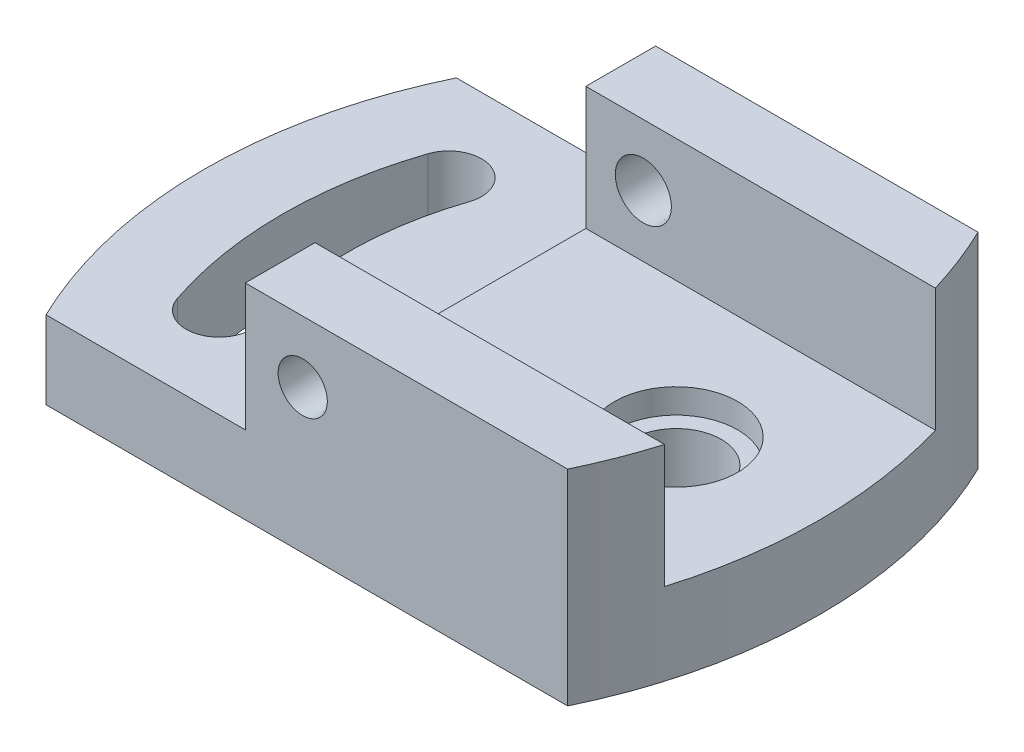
ISO-10303-21;
HEADER;
FILE_DESCRIPTION(('STEP AP214'),'2;1');
FILE_NAME('part.step','',(''),(''),'','','');
FILE_SCHEMA(('AUTOMOTIVE_DESIGN { 1 0 10303 214 1 1 1 1 }'));
ENDSEC;
DATA;
#1=APPLICATION_CONTEXT('core data for automotive mechanical design processes');
#2=APPLICATION_PROTOCOL_DEFINITION('international standard','automotive_design',2000,#1);
#3=PRODUCT_CONTEXT('',#1,'mechanical');
#4=PRODUCT('Part','Part','',(#3));
#5=PRODUCT_RELATED_PRODUCT_CATEGORY('part','',(#4));
#6=PRODUCT_DEFINITION_FORMATION('','',#4);
#7=PRODUCT_DEFINITION_CONTEXT('part definition',#1,'design');
#8=PRODUCT_DEFINITION('design','',#6,#7);
#9=PRODUCT_DEFINITION_SHAPE('','',#8);
#10=(LENGTH_UNIT() NAMED_UNIT(*) SI_UNIT(.MILLI.,.METRE.));
#11=(NAMED_UNIT(*) PLANE_ANGLE_UNIT() SI_UNIT($,.RADIAN.));
#12=(NAMED_UNIT(*) SI_UNIT($,.STERADIAN.) SOLID_ANGLE_UNIT());
#13=UNCERTAINTY_MEASURE_WITH_UNIT(LENGTH_MEASURE(1.E-05),#10,'distance_accuracy_value','');
#14=(GEOMETRIC_REPRESENTATION_CONTEXT(3) GLOBAL_UNCERTAINTY_ASSIGNED_CONTEXT((#13)) GLOBAL_UNIT_ASSIGNED_CONTEXT((#10,
#11,#12)) REPRESENTATION_CONTEXT('',''));
#15=CARTESIAN_POINT('',(0.,0.,0.));
#16=DIRECTION('',(0.,0.,1.));
#17=DIRECTION('',(1.,0.,0.));
#18=AXIS2_PLACEMENT_3D('',#15,#16,#17);
#19=CARTESIAN_POINT('',(40.0000000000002,0.,0.));
#20=DIRECTION('',(0.,1.,0.));
#21=DIRECTION('',(0.,0.,1.));
#22=AXIS2_PLACEMENT_3D('',#19,#20,#21);
#23=PLANE('',#22);
#24=CARTESIAN_POINT('',(40.0000000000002,0.,0.));
#25=DIRECTION('',(0.,1.,0.));
#26=DIRECTION('',(0.,0.,1.));
#27=AXIS2_PLACEMENT_3D('',#24,#25,#26);
#28=CIRCLE('',#27,115.);
#29=CARTESIAN_POINT('',(-63.5615758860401,0.,-50.0000000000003));
#30=VERTEX_POINT('',#29);
#31=CARTESIAN_POINT('',(-63.56157588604,0.,50.0000000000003));
#32=VERTEX_POINT('',#31);
#33=EDGE_CURVE('E224',#30,#32,#28,.T.);
#34=ORIENTED_EDGE('',*,*,#33,.F.);
#35=DIRECTION('',(-1.,0.,0.));
#36=VECTOR('',#35,1.);
#37=CARTESIAN_POINT('',(-63.5615758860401,0.,-50.0000000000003));
#38=LINE('',#37,#36);
#39=CARTESIAN_POINT('',(63.5615758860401,0.,-50.0000000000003));
#40=VERTEX_POINT('',#39);
#41=EDGE_CURVE('E242',#40,#30,#38,.T.);
#42=ORIENTED_EDGE('',*,*,#41,.F.);
#43=CARTESIAN_POINT('',(-40.0000000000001,0.,0.));
#44=DIRECTION('',(0.,1.,0.));
#45=DIRECTION('',(0.,0.,-1.));
#46=AXIS2_PLACEMENT_3D('',#43,#44,#45);
#47=CIRCLE('',#46,115.);
#48=CARTESIAN_POINT('',(63.5615758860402,0.,50.0000000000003));
#49=VERTEX_POINT('',#48);
#50=EDGE_CURVE('E236',#49,#40,#47,.T.);
#51=ORIENTED_EDGE('',*,*,#50,.F.);
#52=DIRECTION('',(1.,0.,0.));
#53=VECTOR('',#52,1.);
#54=CARTESIAN_POINT('',(-63.56157588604,0.,50.0000000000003));
#55=LINE('',#54,#53);
#56=EDGE_CURVE('E230',#32,#49,#55,.T.);
#57=ORIENTED_EDGE('',*,*,#56,.F.);
#58=EDGE_LOOP('',(#34,#42,#51,#57));
#59=FACE_BOUND('',#58,.T.);
#60=CARTESIAN_POINT('',(-43.4266144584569,0.,28.0000000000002));
#61=DIRECTION('',(0.,1.,0.));
#62=DIRECTION('',(0.,0.,-1.));
#63=AXIS2_PLACEMENT_3D('',#60,#61,#62);
#64=CIRCLE('',#63,8.00000000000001);
#65=CARTESIAN_POINT('',(-51.0108521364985,0.,30.5454545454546));
#66=VERTEX_POINT('',#65);
#67=CARTESIAN_POINT('',(-35.8423767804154,0.,25.4545454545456));
#68=VERTEX_POINT('',#67);
#69=EDGE_CURVE('E162',#66,#68,#64,.T.);
#70=ORIENTED_EDGE('',*,*,#69,.T.);
#71=CARTESIAN_POINT('',(40.0000000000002,0.,0.));
#72=DIRECTION('',(0.,-1.,0.));
#73=DIRECTION('',(0.,0.,1.));
#74=AXIS2_PLACEMENT_3D('',#71,#72,#73);
#75=CIRCLE('',#74,80.);
#76=CARTESIAN_POINT('',(-35.8423767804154,0.,-25.4545454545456));
#77=VERTEX_POINT('',#76);
#78=EDGE_CURVE('E153',#68,#77,#75,.T.);
#79=ORIENTED_EDGE('',*,*,#78,.T.);
#80=CARTESIAN_POINT('',(-43.426614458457,0.,-28.0000000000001));
#81=DIRECTION('',(0.,1.,0.));
#82=DIRECTION('',(0.,0.,1.));
#83=AXIS2_PLACEMENT_3D('',#80,#81,#82);
#84=CIRCLE('',#83,8.00000000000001);
#85=CARTESIAN_POINT('',(-51.0108521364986,0.,-30.5454545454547));
#86=VERTEX_POINT('',#85);
#87=EDGE_CURVE('E159',#77,#86,#84,.T.);
#88=ORIENTED_EDGE('',*,*,#87,.T.);
#89=CARTESIAN_POINT('',(40.0000000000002,0.,0.));
#90=DIRECTION('',(0.,1.,0.));
#91=DIRECTION('',(0.,0.,1.));
#92=AXIS2_PLACEMENT_3D('',#89,#90,#91);
#93=CIRCLE('',#92,96.);
#94=EDGE_CURVE('E55',#86,#66,#93,.T.);
#95=ORIENTED_EDGE('',*,*,#94,.T.);
#96=EDGE_LOOP('',(#70,#79,#88,#95));
#97=FACE_BOUND('',#96,.T.);
#98=CARTESIAN_POINT('',(40.0000000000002,0.,0.));
#99=DIRECTION('',(0.,1.,0.));
#100=DIRECTION('',(-1.,0.,0.));
#101=AXIS2_PLACEMENT_3D('',#98,#99,#100);
#102=CIRCLE('',#101,11.);
#103=CARTESIAN_POINT('',(29.0000000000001,0.,0.));
#104=VERTEX_POINT('',#103);
#105=EDGE_CURVE('E373',#104,#104,#102,.T.);
#106=ORIENTED_EDGE('',*,*,#105,.T.);
#107=EDGE_LOOP('',(#106));
#108=FACE_BOUND('',#107,.T.);
#109=ADVANCED_FACE('F30',(#59,#97,#108),#23,.F.);
#110=CARTESIAN_POINT('',(-40.0000000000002,20.,0.));
#111=DIRECTION('',(0.,1.,0.));
#112=DIRECTION('',(0.,0.,1.));
#113=AXIS2_PLACEMENT_3D('',#110,#111,#112);
#114=PLANE('',#113);
#115=CARTESIAN_POINT('',(-40.0000000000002,20.,0.));
#116=DIRECTION('',(0.,1.,0.));
#117=DIRECTION('',(0.,0.,1.));
#118=AXIS2_PLACEMENT_3D('',#115,#116,#117);
#119=CIRCLE('',#118,115.);
#120=CARTESIAN_POINT('',(70.1635148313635,20.,33.0000000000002));
#121=VERTEX_POINT('',#120);
#122=CARTESIAN_POINT('',(70.1635148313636,20.,-33.0000000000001));
#123=VERTEX_POINT('',#122);
#124=EDGE_CURVE('E182',#121,#123,#119,.T.);
#125=ORIENTED_EDGE('',*,*,#124,.T.);
#126=DIRECTION('',(-1.,0.,0.));
#127=VECTOR('',#126,1.);
#128=CARTESIAN_POINT('',(70.1635148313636,20.,-33.0000000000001));
#129=LINE('',#128,#127);
#130=CARTESIAN_POINT('',(-15.0000000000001,20.,-33.0000000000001));
#131=VERTEX_POINT('',#130);
#132=EDGE_CURVE('E185',#123,#131,#129,.T.);
#133=ORIENTED_EDGE('',*,*,#132,.T.);
#134=DIRECTION('',(0.,0.,1.));
#135=VECTOR('',#134,1.);
#136=CARTESIAN_POINT('',(-15.0000000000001,20.,-33.0000000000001));
#137=LINE('',#136,#135);
#138=CARTESIAN_POINT('',(-15.,20.,33.0000000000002));
#139=VERTEX_POINT('',#138);
#140=EDGE_CURVE('E188',#131,#139,#137,.T.);
#141=ORIENTED_EDGE('',*,*,#140,.T.);
#142=DIRECTION('',(1.,0.,0.));
#143=VECTOR('',#142,1.);
#144=CARTESIAN_POINT('',(70.1635148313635,20.,33.0000000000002));
#145=LINE('',#144,#143);
#146=EDGE_CURVE('E190',#139,#121,#145,.T.);
#147=ORIENTED_EDGE('',*,*,#146,.T.);
#148=EDGE_LOOP('',(#125,#133,#141,#147));
#149=FACE_BOUND('',#148,.T.);
#150=CARTESIAN_POINT('',(40.0000000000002,20.,0.));
#151=DIRECTION('',(0.,1.,0.));
#152=DIRECTION('',(-1.,0.,0.));
#153=AXIS2_PLACEMENT_3D('',#150,#151,#152);
#154=CIRCLE('',#153,15.);
#155=CARTESIAN_POINT('',(25.0000000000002,20.,0.));
#156=VERTEX_POINT('',#155);
#157=EDGE_CURVE('E381',#156,#156,#154,.T.);
#158=ORIENTED_EDGE('',*,*,#157,.F.);
#159=EDGE_LOOP('',(#158));
#160=FACE_BOUND('',#159,.T.);
#161=ADVANCED_FACE('F294',(#149,#160),#114,.T.);
#162=CARTESIAN_POINT('',(-40.0000000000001,50.,0.));
#163=DIRECTION('',(0.,1.,0.));
#164=DIRECTION('',(0.,0.,1.));
#165=AXIS2_PLACEMENT_3D('',#162,#163,#164);
#166=PLANE('',#165);
#167=DIRECTION('',(1.,0.,0.));
#168=VECTOR('',#167,1.);
#169=CARTESIAN_POINT('',(70.1635148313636,50.,33.0000000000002));
#170=LINE('',#169,#168);
#171=CARTESIAN_POINT('',(-15.0000000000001,50.,33.0000000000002));
#172=VERTEX_POINT('',#171);
#173=CARTESIAN_POINT('',(70.1635148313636,50.,33.0000000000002));
#174=VERTEX_POINT('',#173);
#175=EDGE_CURVE('E180',#172,#174,#170,.T.);
#176=ORIENTED_EDGE('',*,*,#175,.F.);
#177=DIRECTION('',(0.,0.,1.));
#178=VECTOR('',#177,1.);
#179=CARTESIAN_POINT('',(-15.0000000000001,50.,50.0000000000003));
#180=LINE('',#179,#178);
#181=CARTESIAN_POINT('',(-15.0000000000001,50.,50.0000000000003));
#182=VERTEX_POINT('',#181);
#183=EDGE_CURVE('E270',#172,#182,#180,.T.);
#184=ORIENTED_EDGE('',*,*,#183,.T.);
#185=DIRECTION('',(1.,0.,0.));
#186=VECTOR('',#185,1.);
#187=CARTESIAN_POINT('',(-15.0000000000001,50.,50.0000000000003));
#188=LINE('',#187,#186);
#189=CARTESIAN_POINT('',(63.5615758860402,50.,50.0000000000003));
#190=VERTEX_POINT('',#189);
#191=EDGE_CURVE('E220',#182,#190,#188,.T.);
#192=ORIENTED_EDGE('',*,*,#191,.T.);
#193=CARTESIAN_POINT('',(-40.0000000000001,50.,0.));
#194=DIRECTION('',(0.,1.,0.));
#195=DIRECTION('',(0.,0.,1.));
#196=AXIS2_PLACEMENT_3D('',#193,#194,#195);
#197=CIRCLE('',#196,115.);
#198=EDGE_CURVE('E206',#190,#174,#197,.T.);
#199=ORIENTED_EDGE('',*,*,#198,.T.);
#200=EDGE_LOOP('',(#176,#184,#192,#199));
#201=FACE_BOUND('',#200,.T.);
#202=ADVANCED_FACE('F299',(#201),#166,.T.);
#203=CARTESIAN_POINT('',(40.0000000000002,19.,0.));
#204=DIRECTION('',(0.,-1.,0.));
#205=DIRECTION('',(0.,0.,-1.));
#206=AXIS2_PLACEMENT_3D('',#203,#204,#205);
#207=CYLINDRICAL_SURFACE('',#206,115.);
#208=ORIENTED_EDGE('',*,*,#33,.T.);
#209=DIRECTION('',(0.,-1.,0.));
#210=VECTOR('',#209,1.);
#211=CARTESIAN_POINT('',(-63.5615758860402,19.,50.0000000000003));
#212=LINE('',#211,#210);
#213=CARTESIAN_POINT('',(-63.5615758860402,19.,50.0000000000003));
#214=VERTEX_POINT('',#213);
#215=EDGE_CURVE('E11',#214,#32,#212,.T.);
#216=ORIENTED_EDGE('',*,*,#215,.F.);
#217=CARTESIAN_POINT('',(40.0000000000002,19.,0.));
#218=DIRECTION('',(0.,1.,0.));
#219=DIRECTION('',(0.,0.,1.));
#220=AXIS2_PLACEMENT_3D('',#217,#218,#219);
#221=CIRCLE('',#220,115.);
#222=CARTESIAN_POINT('',(-63.5615758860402,19.,-50.0000000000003));
#223=VERTEX_POINT('',#222);
#224=EDGE_CURVE('E244',#223,#214,#221,.T.);
#225=ORIENTED_EDGE('',*,*,#224,.F.);
#226=DIRECTION('',(0.,-1.,0.));
#227=VECTOR('',#226,1.);
#228=CARTESIAN_POINT('',(-63.5615758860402,19.,-50.0000000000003));
#229=LINE('',#228,#227);
#230=EDGE_CURVE('E256',#223,#30,#229,.T.);
#231=ORIENTED_EDGE('',*,*,#230,.T.);
#232=EDGE_LOOP('',(#208,#216,#225,#231));
#233=FACE_BOUND('',#232,.T.);
#234=ADVANCED_FACE('F32',(#233),#207,.T.);
#235=CARTESIAN_POINT('',(-63.5615758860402,19.,50.0000000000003));
#236=DIRECTION('',(0.,0.,-1.));
#237=DIRECTION('',(-1.,0.,0.));
#238=AXIS2_PLACEMENT_3D('',#235,#236,#237);
#239=PLANE('',#238);
#240=CARTESIAN_POINT('',(-1.00000000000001,35.,50.0000000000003));
#241=DIRECTION('',(0.,0.,1.));
#242=DIRECTION('',(1.,0.,0.));
#243=AXIS2_PLACEMENT_3D('',#240,#241,#242);
#244=CIRCLE('',#243,6.);
#245=CARTESIAN_POINT('',(5.00000000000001,35.,50.0000000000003));
#246=VERTEX_POINT('',#245);
#247=EDGE_CURVE('E167',#246,#246,#244,.T.);
#248=ORIENTED_EDGE('',*,*,#247,.F.);
#249=EDGE_LOOP('',(#248));
#250=FACE_BOUND('',#249,.T.);
#251=ORIENTED_EDGE('',*,*,#56,.T.);
#252=DIRECTION('',(0.,-1.,0.));
#253=VECTOR('',#252,1.);
#254=CARTESIAN_POINT('',(63.5615758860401,19.,50.0000000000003));
#255=LINE('',#254,#253);
#256=EDGE_CURVE('E39',#190,#49,#255,.T.);
#257=ORIENTED_EDGE('',*,*,#256,.F.);
#258=ORIENTED_EDGE('',*,*,#191,.F.);
#259=DIRECTION('',(0.,-1.,0.));
#260=VECTOR('',#259,1.);
#261=CARTESIAN_POINT('',(-15.0000000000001,50.,50.0000000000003));
#262=LINE('',#261,#260);
#263=CARTESIAN_POINT('',(-15.0000000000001,19.,50.0000000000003));
#264=VERTEX_POINT('',#263);
#265=EDGE_CURVE('E216',#182,#264,#262,.T.);
#266=ORIENTED_EDGE('',*,*,#265,.T.);
#267=DIRECTION('',(1.,0.,0.));
#268=VECTOR('',#267,1.);
#269=CARTESIAN_POINT('',(-63.5615758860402,19.,50.0000000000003));
#270=LINE('',#269,#268);
#271=EDGE_CURVE('E247',#214,#264,#270,.T.);
#272=ORIENTED_EDGE('',*,*,#271,.F.);
#273=ORIENTED_EDGE('',*,*,#215,.T.);
#274=EDGE_LOOP('',(#251,#257,#258,#266,#272,#273));
#275=FACE_BOUND('',#274,.T.);
#276=ADVANCED_FACE('F264',(#250,#275),#239,.F.);
#277=CARTESIAN_POINT('',(-40.0000000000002,19.,0.));
#278=DIRECTION('',(0.,-1.,0.));
#279=DIRECTION('',(0.,0.,-1.));
#280=AXIS2_PLACEMENT_3D('',#277,#278,#279);
#281=CYLINDRICAL_SURFACE('',#280,115.);
#282=ORIENTED_EDGE('',*,*,#124,.F.);
#283=DIRECTION('',(0.,1.,0.));
#284=VECTOR('',#283,1.);
#285=CARTESIAN_POINT('',(70.1635148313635,20.,33.0000000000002));
#286=LINE('',#285,#284);
#287=EDGE_CURVE('E194',#121,#174,#286,.T.);
#288=ORIENTED_EDGE('',*,*,#287,.T.);
#289=ORIENTED_EDGE('',*,*,#198,.F.);
#290=ORIENTED_EDGE('',*,*,#256,.T.);
#291=ORIENTED_EDGE('',*,*,#50,.T.);
#292=DIRECTION('',(0.,-1.,0.));
#293=VECTOR('',#292,1.);
#294=CARTESIAN_POINT('',(63.5615758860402,19.,-50.0000000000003));
#295=LINE('',#294,#293);
#296=CARTESIAN_POINT('',(63.5615758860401,50.,-50.0000000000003));
#297=VERTEX_POINT('',#296);
#298=EDGE_CURVE('E254',#297,#40,#295,.T.);
#299=ORIENTED_EDGE('',*,*,#298,.F.);
#300=CARTESIAN_POINT('',(70.1635148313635,50.,-33.0000000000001));
#301=VERTEX_POINT('',#300);
#302=EDGE_CURVE('E212',#301,#297,#197,.T.);
#303=ORIENTED_EDGE('',*,*,#302,.F.);
#304=DIRECTION('',(0.,1.,0.));
#305=VECTOR('',#304,1.);
#306=CARTESIAN_POINT('',(70.1635148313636,20.,-33.0000000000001));
#307=LINE('',#306,#305);
#308=EDGE_CURVE('E193',#123,#301,#307,.T.);
#309=ORIENTED_EDGE('',*,*,#308,.F.);
#310=EDGE_LOOP('',(#282,#288,#289,#290,#291,#299,#303,#309));
#311=FACE_BOUND('',#310,.T.);
#312=ADVANCED_FACE('F288',(#311),#281,.T.);
#313=CARTESIAN_POINT('',(-63.5615758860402,19.,-50.0000000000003));
#314=DIRECTION('',(0.,0.,1.));
#315=DIRECTION('',(1.,0.,0.));
#316=AXIS2_PLACEMENT_3D('',#313,#314,#315);
#317=PLANE('',#316);
#318=CARTESIAN_POINT('',(-1.00000000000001,35.,-50.0000000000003));
#319=DIRECTION('',(0.,0.,-1.));
#320=DIRECTION('',(-1.,0.,0.));
#321=AXIS2_PLACEMENT_3D('',#318,#319,#320);
#322=CIRCLE('',#321,7.);
#323=CARTESIAN_POINT('',(-8.00000000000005,35.,-50.0000000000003));
#324=VERTEX_POINT('',#323);
#325=EDGE_CURVE('E172',#324,#324,#322,.T.);
#326=ORIENTED_EDGE('',*,*,#325,.F.);
#327=EDGE_LOOP('',(#326));
#328=FACE_BOUND('',#327,.T.);
#329=ORIENTED_EDGE('',*,*,#41,.T.);
#330=ORIENTED_EDGE('',*,*,#230,.F.);
#331=DIRECTION('',(-1.,0.,0.));
#332=VECTOR('',#331,1.);
#333=CARTESIAN_POINT('',(-63.5615758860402,19.,-50.0000000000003));
#334=LINE('',#333,#332);
#335=CARTESIAN_POINT('',(-15.,19.,-50.0000000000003));
#336=VERTEX_POINT('',#335);
#337=EDGE_CURVE('E213',#336,#223,#334,.T.);
#338=ORIENTED_EDGE('',*,*,#337,.F.);
#339=DIRECTION('',(0.,-1.,0.));
#340=VECTOR('',#339,1.);
#341=CARTESIAN_POINT('',(-15.0000000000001,50.,-50.0000000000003));
#342=LINE('',#341,#340);
#343=CARTESIAN_POINT('',(-15.0000000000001,50.,-50.0000000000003));
#344=VERTEX_POINT('',#343);
#345=EDGE_CURVE('E219',#344,#336,#342,.T.);
#346=ORIENTED_EDGE('',*,*,#345,.F.);
#347=DIRECTION('',(-1.,0.,0.));
#348=VECTOR('',#347,1.);
#349=CARTESIAN_POINT('',(63.5615758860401,50.,-50.0000000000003));
#350=LINE('',#349,#348);
#351=EDGE_CURVE('E279',#297,#344,#350,.T.);
#352=ORIENTED_EDGE('',*,*,#351,.F.);
#353=ORIENTED_EDGE('',*,*,#298,.T.);
#354=EDGE_LOOP('',(#329,#330,#338,#346,#352,#353));
#355=FACE_BOUND('',#354,.T.);
#356=ADVANCED_FACE('F261',(#328,#355),#317,.F.);
#357=CARTESIAN_POINT('',(40.0000000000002,19.,0.));
#358=DIRECTION('',(0.,1.,0.));
#359=DIRECTION('',(0.,0.,1.));
#360=AXIS2_PLACEMENT_3D('',#357,#358,#359);
#361=PLANE('',#360);
#362=CARTESIAN_POINT('',(40.0000000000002,19.,0.));
#363=DIRECTION('',(0.,-1.,0.));
#364=DIRECTION('',(0.,0.,1.));
#365=AXIS2_PLACEMENT_3D('',#362,#363,#364);
#366=CIRCLE('',#365,80.);
#367=CARTESIAN_POINT('',(-35.8423767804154,19.,25.4545454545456));
#368=VERTEX_POINT('',#367);
#369=CARTESIAN_POINT('',(-35.8423767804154,19.,-25.4545454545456));
#370=VERTEX_POINT('',#369);
#371=EDGE_CURVE('E47',#368,#370,#366,.T.);
#372=ORIENTED_EDGE('',*,*,#371,.F.);
#373=CARTESIAN_POINT('',(-43.426614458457,19.,28.0000000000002));
#374=DIRECTION('',(0.,1.,0.));
#375=DIRECTION('',(0.,0.,-1.));
#376=AXIS2_PLACEMENT_3D('',#373,#374,#375);
#377=CIRCLE('',#376,8.00000000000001);
#378=CARTESIAN_POINT('',(-51.0108521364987,19.,30.5454545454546));
#379=VERTEX_POINT('',#378);
#380=EDGE_CURVE('E151',#379,#368,#377,.T.);
#381=ORIENTED_EDGE('',*,*,#380,.F.);
#382=CARTESIAN_POINT('',(40.0000000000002,19.,0.));
#383=DIRECTION('',(0.,1.,0.));
#384=DIRECTION('',(0.,0.,1.));
#385=AXIS2_PLACEMENT_3D('',#382,#383,#384);
#386=CIRCLE('',#385,96.);
#387=CARTESIAN_POINT('',(-51.0108521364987,19.,-30.5454545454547));
#388=VERTEX_POINT('',#387);
#389=EDGE_CURVE('E135',#388,#379,#386,.T.);
#390=ORIENTED_EDGE('',*,*,#389,.F.);
#391=CARTESIAN_POINT('',(-43.426614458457,19.,-28.0000000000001));
#392=DIRECTION('',(0.,1.,0.));
#393=DIRECTION('',(0.,0.,1.));
#394=AXIS2_PLACEMENT_3D('',#391,#392,#393);
#395=CIRCLE('',#394,8.00000000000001);
#396=EDGE_CURVE('E144',#370,#388,#395,.T.);
#397=ORIENTED_EDGE('',*,*,#396,.F.);
#398=EDGE_LOOP('',(#372,#381,#390,#397));
#399=FACE_BOUND('',#398,.T.);
#400=DIRECTION('',(0.,0.,1.));
#401=VECTOR('',#400,1.);
#402=CARTESIAN_POINT('',(-15.0000000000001,19.,50.0000000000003));
#403=LINE('',#402,#401);
#404=EDGE_CURVE('E197',#336,#264,#403,.T.);
#405=ORIENTED_EDGE('',*,*,#404,.F.);
#406=ORIENTED_EDGE('',*,*,#337,.T.);
#407=ORIENTED_EDGE('',*,*,#224,.T.);
#408=ORIENTED_EDGE('',*,*,#271,.T.);
#409=EDGE_LOOP('',(#405,#406,#407,#408));
#410=FACE_BOUND('',#409,.T.);
#411=ADVANCED_FACE('F148',(#399,#410),#361,.T.);
#412=CARTESIAN_POINT('',(-15.0000000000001,50.,50.0000000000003));
#413=DIRECTION('',(1.,0.,0.));
#414=DIRECTION('',(0.,0.,-1.));
#415=AXIS2_PLACEMENT_3D('',#412,#413,#414);
#416=PLANE('',#415);
#417=ORIENTED_EDGE('',*,*,#183,.F.);
#418=DIRECTION('',(0.,1.,0.));
#419=VECTOR('',#418,1.);
#420=CARTESIAN_POINT('',(-15.,20.,33.0000000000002));
#421=LINE('',#420,#419);
#422=EDGE_CURVE('E198',#139,#172,#421,.T.);
#423=ORIENTED_EDGE('',*,*,#422,.F.);
#424=ORIENTED_EDGE('',*,*,#140,.F.);
#425=DIRECTION('',(0.,1.,0.));
#426=VECTOR('',#425,1.);
#427=CARTESIAN_POINT('',(-15.0000000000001,20.,-33.0000000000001));
#428=LINE('',#427,#426);
#429=CARTESIAN_POINT('',(-15.0000000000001,50.,-33.0000000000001));
#430=VERTEX_POINT('',#429);
#431=EDGE_CURVE('E200',#131,#430,#428,.T.);
#432=ORIENTED_EDGE('',*,*,#431,.T.);
#433=EDGE_CURVE('E275',#344,#430,#180,.T.);
#434=ORIENTED_EDGE('',*,*,#433,.F.);
#435=ORIENTED_EDGE('',*,*,#345,.T.);
#436=ORIENTED_EDGE('',*,*,#404,.T.);
#437=ORIENTED_EDGE('',*,*,#265,.F.);
#438=EDGE_LOOP('',(#417,#423,#424,#432,#434,#435,#436,#437));
#439=FACE_BOUND('',#438,.T.);
#440=ADVANCED_FACE('F268',(#439),#416,.F.);
#441=DIRECTION('',(-1.,0.,0.));
#442=VECTOR('',#441,1.);
#443=CARTESIAN_POINT('',(70.1635148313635,50.,-33.0000000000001));
#444=LINE('',#443,#442);
#445=EDGE_CURVE('E178',#301,#430,#444,.T.);
#446=ORIENTED_EDGE('',*,*,#445,.F.);
#447=ORIENTED_EDGE('',*,*,#302,.T.);
#448=ORIENTED_EDGE('',*,*,#351,.T.);
#449=ORIENTED_EDGE('',*,*,#433,.T.);
#450=EDGE_LOOP('',(#446,#447,#448,#449));
#451=FACE_BOUND('',#450,.T.);
#452=ADVANCED_FACE('F284',(#451),#166,.T.);
#453=CARTESIAN_POINT('',(70.1635148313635,20.,33.0000000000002));
#454=DIRECTION('',(0.,0.,1.));
#455=DIRECTION('',(1.,0.,0.));
#456=AXIS2_PLACEMENT_3D('',#453,#454,#455);
#457=PLANE('',#456);
#458=CARTESIAN_POINT('',(-1.,35.,33.0000000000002));
#459=DIRECTION('',(0.,0.,1.));
#460=DIRECTION('',(1.,0.,0.));
#461=AXIS2_PLACEMENT_3D('',#458,#459,#460);
#462=CIRCLE('',#461,6.17);
#463=CARTESIAN_POINT('',(5.17000000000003,35.,33.0000000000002));
#464=VERTEX_POINT('',#463);
#465=EDGE_CURVE('E175',#464,#464,#462,.T.);
#466=ORIENTED_EDGE('',*,*,#465,.T.);
#467=EDGE_LOOP('',(#466));
#468=FACE_BOUND('',#467,.T.);
#469=ORIENTED_EDGE('',*,*,#175,.T.);
#470=ORIENTED_EDGE('',*,*,#287,.F.);
#471=ORIENTED_EDGE('',*,*,#146,.F.);
#472=ORIENTED_EDGE('',*,*,#422,.T.);
#473=EDGE_LOOP('',(#469,#470,#471,#472));
#474=FACE_BOUND('',#473,.T.);
#475=ADVANCED_FACE('F298',(#468,#474),#457,.F.);
#476=CARTESIAN_POINT('',(70.1635148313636,20.,-33.0000000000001));
#477=DIRECTION('',(0.,0.,-1.));
#478=DIRECTION('',(-1.,0.,0.));
#479=AXIS2_PLACEMENT_3D('',#476,#477,#478);
#480=PLANE('',#479);
#481=CARTESIAN_POINT('',(-1.00000000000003,35.,-33.0000000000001));
#482=DIRECTION('',(0.,0.,-1.));
#483=DIRECTION('',(-1.,0.,0.));
#484=AXIS2_PLACEMENT_3D('',#481,#482,#483);
#485=CIRCLE('',#484,6.83);
#486=CARTESIAN_POINT('',(-7.83000000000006,35.,-33.0000000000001));
#487=VERTEX_POINT('',#486);
#488=EDGE_CURVE('E34',#487,#487,#485,.T.);
#489=ORIENTED_EDGE('',*,*,#488,.T.);
#490=EDGE_LOOP('',(#489));
#491=FACE_BOUND('',#490,.T.);
#492=ORIENTED_EDGE('',*,*,#445,.T.);
#493=ORIENTED_EDGE('',*,*,#431,.F.);
#494=ORIENTED_EDGE('',*,*,#132,.F.);
#495=ORIENTED_EDGE('',*,*,#308,.T.);
#496=EDGE_LOOP('',(#492,#493,#494,#495));
#497=FACE_BOUND('',#496,.T.);
#498=ADVANCED_FACE('F292',(#491,#497),#480,.F.);
#499=CARTESIAN_POINT('',(-1.00000000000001,35.,50.0000000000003));
#500=DIRECTION('',(0.,0.,-1.));
#501=DIRECTION('',(-1.,0.,0.));
#502=AXIS2_PLACEMENT_3D('',#499,#500,#501);
#503=CONICAL_SURFACE('',#502,6.,0.00999966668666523);
#504=ORIENTED_EDGE('',*,*,#325,.T.);
#505=EDGE_LOOP('',(#504));
#506=FACE_BOUND('',#505,.T.);
#507=ORIENTED_EDGE('',*,*,#488,.F.);
#508=EDGE_LOOP('',(#507));
#509=FACE_BOUND('',#508,.T.);
#510=ADVANCED_FACE('F333',(#506,#509),#503,.F.);
#511=ORIENTED_EDGE('',*,*,#247,.T.);
#512=EDGE_LOOP('',(#511));
#513=FACE_BOUND('',#512,.T.);
#514=ORIENTED_EDGE('',*,*,#465,.F.);
#515=EDGE_LOOP('',(#514));
#516=FACE_BOUND('',#515,.T.);
#517=ADVANCED_FACE('F329',(#513,#516),#503,.F.);
#518=CARTESIAN_POINT('',(40.0000000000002,0.,0.));
#519=DIRECTION('',(0.,1.,0.));
#520=DIRECTION('',(0.,0.,1.));
#521=AXIS2_PLACEMENT_3D('',#518,#519,#520);
#522=CYLINDRICAL_SURFACE('',#521,80.);
#523=ORIENTED_EDGE('',*,*,#371,.T.);
#524=DIRECTION('',(0.,1.,0.));
#525=VECTOR('',#524,1.);
#526=CARTESIAN_POINT('',(-35.8423767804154,0.,-25.4545454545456));
#527=LINE('',#526,#525);
#528=EDGE_CURVE('E141',#77,#370,#527,.T.);
#529=ORIENTED_EDGE('',*,*,#528,.F.);
#530=ORIENTED_EDGE('',*,*,#78,.F.);
#531=DIRECTION('',(0.,1.,0.));
#532=VECTOR('',#531,1.);
#533=CARTESIAN_POINT('',(-35.8423767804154,0.,25.4545454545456));
#534=LINE('',#533,#532);
#535=EDGE_CURVE('E165',#68,#368,#534,.T.);
#536=ORIENTED_EDGE('',*,*,#535,.T.);
#537=EDGE_LOOP('',(#523,#529,#530,#536));
#538=FACE_BOUND('',#537,.T.);
#539=ADVANCED_FACE('F332',(#538),#522,.T.);
#540=CARTESIAN_POINT('',(-43.4266144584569,0.,28.0000000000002));
#541=DIRECTION('',(0.,1.,0.));
#542=DIRECTION('',(0.,0.,1.));
#543=AXIS2_PLACEMENT_3D('',#540,#541,#542);
#544=CYLINDRICAL_SURFACE('',#543,8.00000000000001);
#545=ORIENTED_EDGE('',*,*,#380,.T.);
#546=ORIENTED_EDGE('',*,*,#535,.F.);
#547=ORIENTED_EDGE('',*,*,#69,.F.);
#548=DIRECTION('',(0.,1.,0.));
#549=VECTOR('',#548,1.);
#550=CARTESIAN_POINT('',(-51.0108521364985,0.,30.5454545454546));
#551=LINE('',#550,#549);
#552=EDGE_CURVE('E140',#66,#379,#551,.T.);
#553=ORIENTED_EDGE('',*,*,#552,.T.);
#554=EDGE_LOOP('',(#545,#546,#547,#553));
#555=FACE_BOUND('',#554,.T.);
#556=ADVANCED_FACE('F346',(#555),#544,.F.);
#557=CARTESIAN_POINT('',(40.0000000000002,0.,0.));
#558=DIRECTION('',(0.,1.,0.));
#559=DIRECTION('',(0.,0.,1.));
#560=AXIS2_PLACEMENT_3D('',#557,#558,#559);
#561=CYLINDRICAL_SURFACE('',#560,96.);
#562=ORIENTED_EDGE('',*,*,#389,.T.);
#563=ORIENTED_EDGE('',*,*,#552,.F.);
#564=ORIENTED_EDGE('',*,*,#94,.F.);
#565=DIRECTION('',(0.,1.,0.));
#566=VECTOR('',#565,1.);
#567=CARTESIAN_POINT('',(-51.0108521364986,0.,-30.5454545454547));
#568=LINE('',#567,#566);
#569=EDGE_CURVE('E131',#86,#388,#568,.T.);
#570=ORIENTED_EDGE('',*,*,#569,.T.);
#571=EDGE_LOOP('',(#562,#563,#564,#570));
#572=FACE_BOUND('',#571,.T.);
#573=ADVANCED_FACE('F133',(#572),#561,.F.);
#574=CARTESIAN_POINT('',(-43.426614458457,0.,-28.0000000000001));
#575=DIRECTION('',(0.,1.,0.));
#576=DIRECTION('',(0.,0.,1.));
#577=AXIS2_PLACEMENT_3D('',#574,#575,#576);
#578=CYLINDRICAL_SURFACE('',#577,8.00000000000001);
#579=ORIENTED_EDGE('',*,*,#396,.T.);
#580=ORIENTED_EDGE('',*,*,#569,.F.);
#581=ORIENTED_EDGE('',*,*,#87,.F.);
#582=ORIENTED_EDGE('',*,*,#528,.T.);
#583=EDGE_LOOP('',(#579,#580,#581,#582));
#584=FACE_BOUND('',#583,.T.);
#585=ADVANCED_FACE('F145',(#584),#578,.F.);
#586=CARTESIAN_POINT('',(40.0000000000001,36.1661866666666,0.));
#587=DIRECTION('',(0.,1.,0.));
#588=DIRECTION('',(-1.,0.,0.));
#589=AXIS2_PLACEMENT_3D('',#586,#587,#588);
#590=CYLINDRICAL_SURFACE('',#589,15.);
#591=ORIENTED_EDGE('',*,*,#157,.T.);
#592=EDGE_LOOP('',(#591));
#593=FACE_BOUND('',#592,.T.);
#594=CARTESIAN_POINT('',(40.0000000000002,14.,0.));
#595=DIRECTION('',(0.,1.,0.));
#596=DIRECTION('',(-1.,0.,0.));
#597=AXIS2_PLACEMENT_3D('',#594,#595,#596);
#598=CIRCLE('',#597,15.);
#599=CARTESIAN_POINT('',(25.0000000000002,14.,0.));
#600=VERTEX_POINT('',#599);
#601=EDGE_CURVE('E376',#600,#600,#598,.T.);
#602=ORIENTED_EDGE('',*,*,#601,.F.);
#603=EDGE_LOOP('',(#602));
#604=FACE_BOUND('',#603,.T.);
#605=ADVANCED_FACE('F349',(#593,#604),#590,.F.);
#606=CARTESIAN_POINT('',(55.0000000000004,14.,0.));
#607=DIRECTION('',(0.,1.,0.));
#608=DIRECTION('',(-1.,0.,0.));
#609=AXIS2_PLACEMENT_3D('',#606,#607,#608);
#610=PLANE('',#609);
#611=ORIENTED_EDGE('',*,*,#601,.T.);
#612=EDGE_LOOP('',(#611));
#613=FACE_BOUND('',#612,.T.);
#614=CARTESIAN_POINT('',(40.0000000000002,14.,0.));
#615=DIRECTION('',(0.,1.,0.));
#616=DIRECTION('',(-1.,0.,0.));
#617=AXIS2_PLACEMENT_3D('',#614,#615,#616);
#618=CIRCLE('',#617,11.);
#619=CARTESIAN_POINT('',(29.0000000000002,14.,0.));
#620=VERTEX_POINT('',#619);
#621=EDGE_CURVE('E370',#620,#620,#618,.T.);
#622=ORIENTED_EDGE('',*,*,#621,.F.);
#623=EDGE_LOOP('',(#622));
#624=FACE_BOUND('',#623,.T.);
#625=ADVANCED_FACE('F357',(#613,#624),#610,.T.);
#626=CARTESIAN_POINT('',(40.0000000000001,36.1661866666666,0.));
#627=DIRECTION('',(0.,1.,0.));
#628=DIRECTION('',(-1.,0.,0.));
#629=AXIS2_PLACEMENT_3D('',#626,#627,#628);
#630=CYLINDRICAL_SURFACE('',#629,11.);
#631=ORIENTED_EDGE('',*,*,#621,.T.);
#632=EDGE_LOOP('',(#631));
#633=FACE_BOUND('',#632,.T.);
#634=ORIENTED_EDGE('',*,*,#105,.F.);
#635=EDGE_LOOP('',(#634));
#636=FACE_BOUND('',#635,.T.);
#637=ADVANCED_FACE('F361',(#633,#636),#630,.F.);
#638=CLOSED_SHELL('',(#109,#161,#202,#234,#276,#312,#356,#411,#440,#452,#475,#498,#510,#517,
#539,#556,#573,#585,#605,#625,#637));
#639=MANIFOLD_SOLID_BREP('B2',#638);
#640=ADVANCED_BREP_SHAPE_REPRESENTATION('',(#18,#639),#14);
#641=SHAPE_DEFINITION_REPRESENTATION(#9,#640);
ENDSEC;
END-ISO-10303-21;
